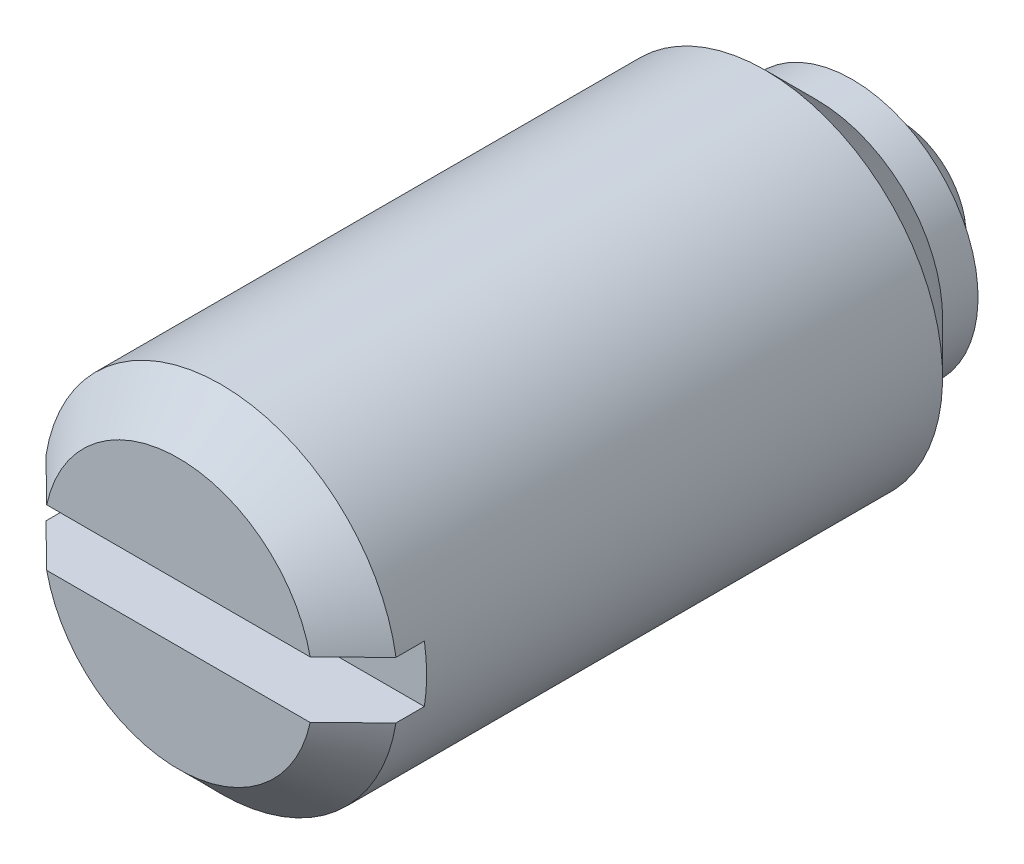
ISO-10303-21;
HEADER;
FILE_DESCRIPTION(('STEP AP214'),'2;1');
FILE_NAME('part.step','',(''),(''),'','','');
FILE_SCHEMA(('AUTOMOTIVE_DESIGN { 1 0 10303 214 1 1 1 1 }'));
ENDSEC;
DATA;
#1=APPLICATION_CONTEXT('core data for automotive mechanical design processes');
#2=APPLICATION_PROTOCOL_DEFINITION('international standard','automotive_design',2000,#1);
#3=PRODUCT_CONTEXT('',#1,'mechanical');
#4=PRODUCT('Part','Part','',(#3));
#5=PRODUCT_RELATED_PRODUCT_CATEGORY('part','',(#4));
#6=PRODUCT_DEFINITION_FORMATION('','',#4);
#7=PRODUCT_DEFINITION_CONTEXT('part definition',#1,'design');
#8=PRODUCT_DEFINITION('design','',#6,#7);
#9=PRODUCT_DEFINITION_SHAPE('','',#8);
#10=(LENGTH_UNIT() NAMED_UNIT(*) SI_UNIT(.MILLI.,.METRE.));
#11=(NAMED_UNIT(*) PLANE_ANGLE_UNIT() SI_UNIT($,.RADIAN.));
#12=(NAMED_UNIT(*) SI_UNIT($,.STERADIAN.) SOLID_ANGLE_UNIT());
#13=UNCERTAINTY_MEASURE_WITH_UNIT(LENGTH_MEASURE(1.E-05),#10,'distance_accuracy_value','');
#14=(GEOMETRIC_REPRESENTATION_CONTEXT(3) GLOBAL_UNCERTAINTY_ASSIGNED_CONTEXT((#13)) GLOBAL_UNIT_ASSIGNED_CONTEXT((#10,
#11,#12)) REPRESENTATION_CONTEXT('',''));
#15=CARTESIAN_POINT('',(0.,0.,0.));
#16=DIRECTION('',(0.,0.,1.));
#17=DIRECTION('',(1.,0.,0.));
#18=AXIS2_PLACEMENT_3D('',#15,#16,#17);
#19=CARTESIAN_POINT('',(0.,0.,1.));
#20=DIRECTION('',(0.,0.,-1.));
#21=DIRECTION('',(-1.,0.,0.));
#22=AXIS2_PLACEMENT_3D('',#19,#20,#21);
#23=CYLINDRICAL_SURFACE('',#22,5.);
#24=CARTESIAN_POINT('',(0.,0.,4.45));
#25=DIRECTION('',(0.,0.,-1.));
#26=DIRECTION('',(0.,1.,0.));
#27=AXIS2_PLACEMENT_3D('',#24,#25,#26);
#28=CIRCLE('',#27,5.);
#29=CARTESIAN_POINT('',(0.,5.,4.45));
#30=VERTEX_POINT('',#29);
#31=EDGE_CURVE('E93',#30,#30,#28,.T.);
#32=ORIENTED_EDGE('',*,*,#31,.F.);
#33=EDGE_LOOP('',(#32));
#34=FACE_BOUND('',#33,.T.);
#35=DIRECTION('',(0.,0.,1.));
#36=VECTOR('',#35,1.);
#37=CARTESIAN_POINT('',(4.93558507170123,-0.8,19.));
#38=LINE('',#37,#36);
#39=CARTESIAN_POINT('',(4.93558507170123,-0.8,19.));
#40=VERTEX_POINT('',#39);
#41=CARTESIAN_POINT('',(4.93558507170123,-0.8,19.8));
#42=VERTEX_POINT('',#41);
#43=EDGE_CURVE('E118',#40,#42,#38,.T.);
#44=ORIENTED_EDGE('',*,*,#43,.T.);
#45=CARTESIAN_POINT('',(0.,0.,19.8));
#46=DIRECTION('',(0.,0.,1.));
#47=DIRECTION('',(1.,0.,0.));
#48=AXIS2_PLACEMENT_3D('',#45,#46,#47);
#49=CIRCLE('',#48,5.);
#50=CARTESIAN_POINT('',(-4.93558507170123,-0.8,19.8));
#51=VERTEX_POINT('',#50);
#52=EDGE_CURVE('E94',#51,#42,#49,.T.);
#53=ORIENTED_EDGE('',*,*,#52,.F.);
#54=DIRECTION('',(0.,0.,1.));
#55=VECTOR('',#54,1.);
#56=CARTESIAN_POINT('',(-4.93558507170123,-0.8,19.));
#57=LINE('',#56,#55);
#58=CARTESIAN_POINT('',(-4.93558507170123,-0.8,19.));
#59=VERTEX_POINT('',#58);
#60=EDGE_CURVE('E34',#59,#51,#57,.T.);
#61=ORIENTED_EDGE('',*,*,#60,.F.);
#62=CARTESIAN_POINT('',(0.,0.,19.));
#63=DIRECTION('',(0.,0.,1.));
#64=DIRECTION('',(1.,0.,0.));
#65=AXIS2_PLACEMENT_3D('',#62,#63,#64);
#66=CIRCLE('',#65,5.);
#67=CARTESIAN_POINT('',(-4.93558507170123,0.8,19.));
#68=VERTEX_POINT('',#67);
#69=EDGE_CURVE('E80',#68,#59,#66,.T.);
#70=ORIENTED_EDGE('',*,*,#69,.F.);
#71=DIRECTION('',(0.,0.,1.));
#72=VECTOR('',#71,1.);
#73=CARTESIAN_POINT('',(-4.93558507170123,0.8,19.));
#74=LINE('',#73,#72);
#75=CARTESIAN_POINT('',(-4.93558507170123,0.8,19.8));
#76=VERTEX_POINT('',#75);
#77=EDGE_CURVE('E76',#68,#76,#74,.T.);
#78=ORIENTED_EDGE('',*,*,#77,.T.);
#79=CARTESIAN_POINT('',(4.93558507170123,0.8,19.8));
#80=VERTEX_POINT('',#79);
#81=EDGE_CURVE('E79',#80,#76,#49,.T.);
#82=ORIENTED_EDGE('',*,*,#81,.F.);
#83=DIRECTION('',(0.,0.,1.));
#84=VECTOR('',#83,1.);
#85=CARTESIAN_POINT('',(4.93558507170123,0.8,19.));
#86=LINE('',#85,#84);
#87=CARTESIAN_POINT('',(4.93558507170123,0.8,19.));
#88=VERTEX_POINT('',#87);
#89=EDGE_CURVE('E42',#88,#80,#86,.T.);
#90=ORIENTED_EDGE('',*,*,#89,.F.);
#91=EDGE_CURVE('E113',#40,#88,#66,.T.);
#92=ORIENTED_EDGE('',*,*,#91,.F.);
#93=EDGE_LOOP('',(#44,#53,#61,#70,#78,#82,#90,#92));
#94=FACE_BOUND('',#93,.T.);
#95=ADVANCED_FACE('F14',(#34,#94),#23,.T.);
#96=CARTESIAN_POINT('',(0.,5.,21.));
#97=DIRECTION('',(0.,0.,1.));
#98=DIRECTION('',(1.,0.,0.));
#99=AXIS2_PLACEMENT_3D('',#96,#97,#98);
#100=PLANE('',#99);
#101=CARTESIAN_POINT('',(0.,0.,21.));
#102=DIRECTION('',(0.,0.,1.));
#103=DIRECTION('',(1.,0.,0.));
#104=AXIS2_PLACEMENT_3D('',#101,#102,#103);
#105=CIRCLE('',#104,3.8);
#106=CARTESIAN_POINT('',(-3.71483512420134,-0.8,21.));
#107=VERTEX_POINT('',#106);
#108=CARTESIAN_POINT('',(3.71483512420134,-0.8,21.));
#109=VERTEX_POINT('',#108);
#110=EDGE_CURVE('E170',#107,#109,#105,.T.);
#111=ORIENTED_EDGE('',*,*,#110,.T.);
#112=DIRECTION('',(1.,0.,0.));
#113=VECTOR('',#112,1.);
#114=CARTESIAN_POINT('',(-4.93558507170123,-0.8,21.));
#115=LINE('',#114,#113);
#116=EDGE_CURVE('E108',#107,#109,#115,.T.);
#117=ORIENTED_EDGE('',*,*,#116,.F.);
#118=EDGE_LOOP('',(#111,#117));
#119=FACE_BOUND('',#118,.T.);
#120=ADVANCED_FACE('F158',(#119),#100,.T.);
#121=CARTESIAN_POINT('',(3.71483512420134,0.8,21.));
#122=VERTEX_POINT('',#121);
#123=CARTESIAN_POINT('',(-3.71483512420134,0.8,21.));
#124=VERTEX_POINT('',#123);
#125=EDGE_CURVE('E100',#122,#124,#105,.T.);
#126=ORIENTED_EDGE('',*,*,#125,.T.);
#127=DIRECTION('',(1.,0.,0.));
#128=VECTOR('',#127,1.);
#129=CARTESIAN_POINT('',(-4.93558507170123,0.8,21.));
#130=LINE('',#129,#128);
#131=EDGE_CURVE('E87',#124,#122,#130,.T.);
#132=ORIENTED_EDGE('',*,*,#131,.T.);
#133=EDGE_LOOP('',(#126,#132));
#134=FACE_BOUND('',#133,.T.);
#135=ADVANCED_FACE('F133',(#134),#100,.T.);
#136=CARTESIAN_POINT('',(0.,0.,19.8));
#137=DIRECTION('',(0.,0.,-1.));
#138=DIRECTION('',(-1.,0.,0.));
#139=AXIS2_PLACEMENT_3D('',#136,#137,#138);
#140=CONICAL_SURFACE('',#139,5.,0.785398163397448);
#141=CARTESIAN_POINT('',(-10.9020904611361,-0.8,13.8685967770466));
#142=CARTESIAN_POINT('',(-10.5220293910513,-0.8,14.2476303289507));
#143=CARTESIAN_POINT('',(-10.1419231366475,-0.8,14.6266186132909));
#144=CARTESIAN_POINT('',(-9.38154892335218,-0.8,15.3844569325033));
#145=CARTESIAN_POINT('',(-9.00128095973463,-0.8,15.7633069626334));
#146=CARTESIAN_POINT('',(-8.24025535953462,-0.8,16.5210765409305));
#147=CARTESIAN_POINT('',(-7.8594975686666,-0.8,16.8999959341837));
#148=CARTESIAN_POINT('',(-7.09767233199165,-0.8,17.6574999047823));
#149=CARTESIAN_POINT('',(-6.71660489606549,-0.8,18.0360844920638));
#150=CARTESIAN_POINT('',(-5.9587167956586,-0.8,18.7880092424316));
#151=CARTESIAN_POINT('',(-5.58190253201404,-0.8,19.1613558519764));
#152=CARTESIAN_POINT('',(-5.01598061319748,-0.8,19.720702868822));
#153=CARTESIAN_POINT('',(-4.82721428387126,-0.8,19.9070485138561));
#154=CARTESIAN_POINT('',(-4.44935817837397,-0.8,20.2794082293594));
#155=CARTESIAN_POINT('',(-4.26026840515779,-0.8,20.4654223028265));
#156=CARTESIAN_POINT('',(-3.88170325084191,-0.8,20.8368850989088));
#157=CARTESIAN_POINT('',(-3.69222808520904,-0.8,21.0223340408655));
#158=CARTESIAN_POINT('',(-3.31253993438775,-0.8,21.3924885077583));
#159=CARTESIAN_POINT('',(-3.12232692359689,-0.8,21.5771940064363));
#160=CARTESIAN_POINT('',(-2.74073953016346,-0.8,21.945343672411));
#161=CARTESIAN_POINT('',(-2.54936534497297,-0.8,22.1287880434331));
#162=CARTESIAN_POINT('',(-2.26063352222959,-0.8,22.402181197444));
#163=CARTESIAN_POINT('',(-2.16411387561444,-0.8,22.4930141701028));
#164=CARTESIAN_POINT('',(-1.97026206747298,-0.8,22.673808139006));
#165=CARTESIAN_POINT('',(-1.87292992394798,-0.8,22.7637691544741));
#166=CARTESIAN_POINT('',(-1.74816551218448,-0.8,22.8775109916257));
#167=CARTESIAN_POINT('',(-1.72129866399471,-0.8,22.9019121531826));
#168=CARTESIAN_POINT('',(-1.66745938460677,-0.8,22.9505978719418));
#169=CARTESIAN_POINT('',(-1.64048695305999,-0.8,22.9748824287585));
#170=CARTESIAN_POINT('',(-1.55938868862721,-0.8,23.047540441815));
#171=CARTESIAN_POINT('',(-1.50508472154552,-0.8,23.0957156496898));
#172=CARTESIAN_POINT('',(-1.39568905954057,-0.8,23.1915077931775));
#173=CARTESIAN_POINT('',(-1.34059545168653,-0.8,23.2391225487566));
#174=CARTESIAN_POINT('',(-1.22958246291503,-0.8,23.3333678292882));
#175=CARTESIAN_POINT('',(-1.17366319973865,-0.8,23.379998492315));
#176=CARTESIAN_POINT('',(-1.0656097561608,-0.8,23.4678504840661));
#177=CARTESIAN_POINT('',(-1.01357108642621,-0.8,23.509188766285));
#178=CARTESIAN_POINT('',(-0.908196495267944,-0.8,23.5901731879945));
#179=CARTESIAN_POINT('',(-0.854860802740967,-0.8,23.6298196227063));
#180=CARTESIAN_POINT('',(-0.746465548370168,-0.8,23.7065006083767));
#181=CARTESIAN_POINT('',(-0.691409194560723,-0.8,23.7435396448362));
#182=CARTESIAN_POINT('',(-0.578805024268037,-0.8,23.8135594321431));
#183=CARTESIAN_POINT('',(-0.521260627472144,-0.8,23.8465455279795));
#184=CARTESIAN_POINT('',(-0.411126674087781,-0.8,23.9016196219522));
#185=CARTESIAN_POINT('',(-0.358991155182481,-0.8,23.9245896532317));
#186=CARTESIAN_POINT('',(-0.251986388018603,-0.8,23.9627243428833));
#187=CARTESIAN_POINT('',(-0.197128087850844,-0.8,23.9779178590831));
#188=CARTESIAN_POINT('',(-0.0947531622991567,-0.8,23.9957042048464));
#189=CARTESIAN_POINT('',(-0.0475435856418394,-0.8,23.9999797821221));
#190=CARTESIAN_POINT('',(0.046845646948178,-0.8,24.000020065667));
#191=CARTESIAN_POINT('',(0.0940253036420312,-0.8,23.9957899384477));
#192=CARTESIAN_POINT('',(0.201408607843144,-0.8,23.9772270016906));
#193=CARTESIAN_POINT('',(0.261125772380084,-0.8,23.9601735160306));
#194=CARTESIAN_POINT('',(0.348198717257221,-0.800000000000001,23.9279331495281));
#195=CARTESIAN_POINT('',(0.376894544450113,-0.800000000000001,23.916026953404));
#196=CARTESIAN_POINT('',(0.433489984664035,-0.8,23.8904505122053));
#197=CARTESIAN_POINT('',(0.461389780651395,-0.8,23.8767806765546));
#198=CARTESIAN_POINT('',(0.536913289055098,-0.8,23.837404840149));
#199=CARTESIAN_POINT('',(0.583799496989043,-0.8,23.8102987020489));
#200=CARTESIAN_POINT('',(0.675882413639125,-0.800000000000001,23.7533323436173));
#201=CARTESIAN_POINT('',(0.721077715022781,-0.8,23.7234698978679));
#202=CARTESIAN_POINT('',(0.810273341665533,-0.8,23.6617985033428));
#203=CARTESIAN_POINT('',(0.854270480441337,-0.8,23.6299849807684));
#204=CARTESIAN_POINT('',(0.941273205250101,-0.8,23.5650249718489));
#205=CARTESIAN_POINT('',(0.98427862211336,-0.8,23.531878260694));
#206=CARTESIAN_POINT('',(1.11263812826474,-0.8,23.4306366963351));
#207=CARTESIAN_POINT('',(1.19684597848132,-0.8,23.3610921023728));
#208=CARTESIAN_POINT('',(1.3216828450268,-0.8,23.2552087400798));
#209=CARTESIAN_POINT('',(1.36301551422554,-0.800000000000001,23.2196834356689));
#210=CARTESIAN_POINT('',(1.44529784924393,-0.8,23.1481928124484));
#211=CARTESIAN_POINT('',(1.48624752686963,-0.8,23.1122275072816));
#212=CARTESIAN_POINT('',(1.60742153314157,-0.8,23.0048935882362));
#213=CARTESIAN_POINT('',(1.68720596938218,-0.8,22.9330292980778));
#214=CARTESIAN_POINT('',(1.84596084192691,-0.800000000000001,22.7884055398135));
#215=CARTESIAN_POINT('',(1.92493125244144,-0.800000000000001,22.7156460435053));
#216=CARTESIAN_POINT('',(2.1609957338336,-0.8,22.496427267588));
#217=CARTESIAN_POINT('',(2.31722802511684,-0.8,22.349041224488));
#218=CARTESIAN_POINT('',(2.6285549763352,-0.800000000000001,22.0528081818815));
#219=CARTESIAN_POINT('',(2.78364852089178,-0.800000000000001,21.9039600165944));
#220=CARTESIAN_POINT('',(3.09302913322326,-0.800000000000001,21.6054455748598));
#221=CARTESIAN_POINT('',(3.24731624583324,-0.800000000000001,21.4557793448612));
#222=CARTESIAN_POINT('',(3.55440275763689,-0.800000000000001,21.1568476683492));
#223=CARTESIAN_POINT('',(3.70720542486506,-0.800000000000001,21.0075855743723));
#224=CARTESIAN_POINT('',(4.01245165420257,-0.800000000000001,20.7086903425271));
#225=CARTESIAN_POINT('',(4.16489521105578,-0.800000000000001,20.5590571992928));
#226=CARTESIAN_POINT('',(4.62173704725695,-0.800000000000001,20.1098673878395));
#227=CARTESIAN_POINT('',(4.925750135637,-0.8,19.8099191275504));
#228=CARTESIAN_POINT('',(5.70175323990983,-0.8,19.0428404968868));
#229=CARTESIAN_POINT('',(6.1733400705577,-0.800000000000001,18.5753026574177));
#230=CARTESIAN_POINT('',(7.11589856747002,-0.800000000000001,17.6394867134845));
#231=CARTESIAN_POINT('',(7.58687014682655,-0.800000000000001,17.1712085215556));
#232=CARTESIAN_POINT('',(8.53205500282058,-0.800000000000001,16.2306512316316));
#233=CARTESIAN_POINT('',(9.00626528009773,-0.800000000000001,15.7583691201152));
#234=CARTESIAN_POINT('',(9.95436699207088,-0.800000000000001,14.8136100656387));
#235=CARTESIAN_POINT('',(10.4282584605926,-0.800000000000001,14.3411331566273));
#236=CARTESIAN_POINT('',(10.9020904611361,-0.8,13.8685967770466));
#237=B_SPLINE_CURVE_WITH_KNOTS('',3,(#141,#142,#143,#144,#145,#146,#147,#148,#149,#150,#151,
#152,#153,#154,#155,#156,#157,#158,#159,#160,#161,#162,#163,#164,#165,#166,#167,#168,#169,#170,
#171,#172,#173,#174,#175,#176,#177,#178,#179,#180,#181,#182,#183,#184,#185,#186,#187,#188,#189,
#190,#191,#192,#193,#194,#195,#196,#197,#198,#199,#200,#201,#202,#203,#204,#205,#206,#207,#208,
#209,#210,#211,#212,#213,#214,#215,#216,#217,#218,#219,#220,#221,#222,#223,#224,#225,#226,#227,
#228,#229,#230,#231,#232,#233,#234,#235,#236),.UNSPECIFIED.,.F.,.F.,(4,2,2,2,2,2,2,2,2,2,2,2,2,
2,2,2,2,2,2,2,2,2,2,2,2,2,2,2,2,2,2,2,2,2,2,2,2,2,2,2,2,2,2,2,2,2,2,4),(0.,1.61028437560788,
3.22061958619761,4.83214282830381,6.44361652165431,8.03496399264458,8.83071293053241,
9.62645463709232,10.4218330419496,11.2172392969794,12.0125138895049,12.4101289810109,
12.8077352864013,12.9166165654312,13.0254982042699,13.2432730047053,13.4617194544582,
13.6801350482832,13.8794913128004,14.0788126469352,14.2777822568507,14.4764865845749,
14.6470220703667,14.8169200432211,14.9583961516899,15.0997863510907,15.2849198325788,
15.3780907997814,15.4712401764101,15.63355803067,15.7960081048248,15.9588547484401,
16.1217289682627,16.449283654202,16.6127889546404,16.7762891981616,17.0984121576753,
17.4205452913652,18.0648722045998,18.7097630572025,19.3546176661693,19.9954370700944,
20.6362657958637,21.9174886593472,23.9096900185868,25.9021475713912,27.9099651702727,
29.917517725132),.UNSPECIFIED.);
#238=EDGE_CURVE('E9',#51,#107,#237,.T.);
#239=ORIENTED_EDGE('',*,*,#238,.F.);
#240=ORIENTED_EDGE('',*,*,#52,.T.);
#241=EDGE_CURVE('E18',#109,#42,#237,.T.);
#242=ORIENTED_EDGE('',*,*,#241,.F.);
#243=ORIENTED_EDGE('',*,*,#110,.F.);
#244=EDGE_LOOP('',(#239,#240,#242,#243));
#245=FACE_BOUND('',#244,.T.);
#246=ADVANCED_FACE('F127',(#245),#140,.T.);
#247=CARTESIAN_POINT('',(10.9020904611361,0.8,13.8685967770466));
#248=CARTESIAN_POINT('',(10.5220293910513,0.799999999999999,14.2476303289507));
#249=CARTESIAN_POINT('',(10.1419231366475,0.799999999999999,14.6266186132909));
#250=CARTESIAN_POINT('',(9.38154892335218,0.799999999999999,15.3844569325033));
#251=CARTESIAN_POINT('',(9.00128095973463,0.799999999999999,15.7633069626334));
#252=CARTESIAN_POINT('',(8.24025535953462,0.799999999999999,16.5210765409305));
#253=CARTESIAN_POINT('',(7.8594975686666,0.799999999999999,16.8999959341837));
#254=CARTESIAN_POINT('',(7.09767233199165,0.8,17.6574999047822));
#255=CARTESIAN_POINT('',(6.71660489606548,0.8,18.0360844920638));
#256=CARTESIAN_POINT('',(5.9587167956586,0.8,18.7880092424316));
#257=CARTESIAN_POINT('',(5.58190253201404,0.8,19.1613558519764));
#258=CARTESIAN_POINT('',(5.01598061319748,0.8,19.720702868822));
#259=CARTESIAN_POINT('',(4.82721428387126,0.8,19.9070485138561));
#260=CARTESIAN_POINT('',(4.44935817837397,0.8,20.2794082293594));
#261=CARTESIAN_POINT('',(4.26026840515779,0.8,20.4654223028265));
#262=CARTESIAN_POINT('',(3.88170325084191,0.8,20.8368850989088));
#263=CARTESIAN_POINT('',(3.69222808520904,0.8,21.0223340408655));
#264=CARTESIAN_POINT('',(3.31253993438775,0.8,21.3924885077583));
#265=CARTESIAN_POINT('',(3.12232692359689,0.8,21.5771940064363));
#266=CARTESIAN_POINT('',(2.74073953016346,0.8,21.945343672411));
#267=CARTESIAN_POINT('',(2.54936534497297,0.8,22.1287880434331));
#268=CARTESIAN_POINT('',(2.26063352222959,0.800000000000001,22.402181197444));
#269=CARTESIAN_POINT('',(2.16411387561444,0.800000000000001,22.4930141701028));
#270=CARTESIAN_POINT('',(1.97026206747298,0.8,22.673808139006));
#271=CARTESIAN_POINT('',(1.87292992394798,0.799999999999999,22.7637691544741));
#272=CARTESIAN_POINT('',(1.74816551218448,0.8,22.8775109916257));
#273=CARTESIAN_POINT('',(1.72129866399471,0.800000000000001,22.9019121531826));
#274=CARTESIAN_POINT('',(1.66745938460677,0.800000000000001,22.9505978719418));
#275=CARTESIAN_POINT('',(1.64048695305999,0.800000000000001,22.9748824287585));
#276=CARTESIAN_POINT('',(1.55938868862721,0.800000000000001,23.047540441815));
#277=CARTESIAN_POINT('',(1.50508472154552,0.800000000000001,23.0957156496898));
#278=CARTESIAN_POINT('',(1.39568905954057,0.800000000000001,23.1915077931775));
#279=CARTESIAN_POINT('',(1.34059545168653,0.800000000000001,23.2391225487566));
#280=CARTESIAN_POINT('',(1.22958246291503,0.800000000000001,23.3333678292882));
#281=CARTESIAN_POINT('',(1.17366319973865,0.8,23.379998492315));
#282=CARTESIAN_POINT('',(1.0656097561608,0.8,23.4678504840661));
#283=CARTESIAN_POINT('',(1.01357108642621,0.800000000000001,23.509188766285));
#284=CARTESIAN_POINT('',(0.908196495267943,0.800000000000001,23.5901731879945));
#285=CARTESIAN_POINT('',(0.854860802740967,0.800000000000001,23.6298196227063));
#286=CARTESIAN_POINT('',(0.746465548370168,0.800000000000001,23.7065006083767));
#287=CARTESIAN_POINT('',(0.691409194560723,0.800000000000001,23.7435396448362));
#288=CARTESIAN_POINT('',(0.578805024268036,0.800000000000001,23.8135594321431));
#289=CARTESIAN_POINT('',(0.521260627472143,0.8,23.8465455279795));
#290=CARTESIAN_POINT('',(0.411126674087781,0.8,23.9016196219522));
#291=CARTESIAN_POINT('',(0.358991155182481,0.800000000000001,23.9245896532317));
#292=CARTESIAN_POINT('',(0.251986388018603,0.800000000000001,23.9627243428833));
#293=CARTESIAN_POINT('',(0.197128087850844,0.8,23.9779178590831));
#294=CARTESIAN_POINT('',(0.0947531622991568,0.8,23.9957042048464));
#295=CARTESIAN_POINT('',(0.0475435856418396,0.800000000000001,23.9999797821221));
#296=CARTESIAN_POINT('',(-0.0468456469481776,0.800000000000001,24.000020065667));
#297=CARTESIAN_POINT('',(-0.0940253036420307,0.8,23.9957899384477));
#298=CARTESIAN_POINT('',(-0.201408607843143,0.8,23.9772270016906));
#299=CARTESIAN_POINT('',(-0.261125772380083,0.800000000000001,23.9601735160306));
#300=CARTESIAN_POINT('',(-0.34819871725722,0.800000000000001,23.9279331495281));
#301=CARTESIAN_POINT('',(-0.376894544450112,0.800000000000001,23.916026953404));
#302=CARTESIAN_POINT('',(-0.433489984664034,0.800000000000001,23.8904505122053));
#303=CARTESIAN_POINT('',(-0.461389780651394,0.8,23.8767806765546));
#304=CARTESIAN_POINT('',(-0.536913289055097,0.8,23.837404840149));
#305=CARTESIAN_POINT('',(-0.583799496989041,0.800000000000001,23.8102987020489));
#306=CARTESIAN_POINT('',(-0.675882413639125,0.800000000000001,23.7533323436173));
#307=CARTESIAN_POINT('',(-0.721077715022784,0.800000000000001,23.7234698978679));
#308=CARTESIAN_POINT('',(-0.810273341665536,0.800000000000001,23.6617985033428));
#309=CARTESIAN_POINT('',(-0.854270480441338,0.800000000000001,23.6299849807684));
#310=CARTESIAN_POINT('',(-0.941273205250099,0.800000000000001,23.5650249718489));
#311=CARTESIAN_POINT('',(-0.984278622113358,0.800000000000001,23.531878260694));
#312=CARTESIAN_POINT('',(-1.11263812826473,0.800000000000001,23.4306366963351));
#313=CARTESIAN_POINT('',(-1.19684597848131,0.800000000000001,23.3610921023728));
#314=CARTESIAN_POINT('',(-1.3216828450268,0.800000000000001,23.2552087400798));
#315=CARTESIAN_POINT('',(-1.36301551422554,0.800000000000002,23.2196834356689));
#316=CARTESIAN_POINT('',(-1.44529784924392,0.800000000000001,23.1481928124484));
#317=CARTESIAN_POINT('',(-1.48624752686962,0.8,23.1122275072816));
#318=CARTESIAN_POINT('',(-1.60742153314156,0.799999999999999,23.0048935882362));
#319=CARTESIAN_POINT('',(-1.68720596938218,0.800000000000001,22.9330292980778));
#320=CARTESIAN_POINT('',(-1.84596084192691,0.800000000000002,22.7884055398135));
#321=CARTESIAN_POINT('',(-1.92493125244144,0.800000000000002,22.7156460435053));
#322=CARTESIAN_POINT('',(-2.1609957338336,0.800000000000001,22.496427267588));
#323=CARTESIAN_POINT('',(-2.31722802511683,0.800000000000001,22.349041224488));
#324=CARTESIAN_POINT('',(-2.6285549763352,0.800000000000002,22.0528081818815));
#325=CARTESIAN_POINT('',(-2.78364852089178,0.800000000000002,21.9039600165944));
#326=CARTESIAN_POINT('',(-3.09302913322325,0.800000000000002,21.6054455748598));
#327=CARTESIAN_POINT('',(-3.24731624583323,0.800000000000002,21.4557793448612));
#328=CARTESIAN_POINT('',(-3.55440275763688,0.800000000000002,21.1568476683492));
#329=CARTESIAN_POINT('',(-3.70720542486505,0.800000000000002,21.0075855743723));
#330=CARTESIAN_POINT('',(-4.01245165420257,0.800000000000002,20.7086903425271));
#331=CARTESIAN_POINT('',(-4.16489521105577,0.800000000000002,20.5590571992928));
#332=CARTESIAN_POINT('',(-4.62173704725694,0.800000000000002,20.1098673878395));
#333=CARTESIAN_POINT('',(-4.92575013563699,0.8,19.8099191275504));
#334=CARTESIAN_POINT('',(-5.70175323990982,0.8,19.0428404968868));
#335=CARTESIAN_POINT('',(-6.17334007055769,0.800000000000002,18.5753026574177));
#336=CARTESIAN_POINT('',(-7.11589856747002,0.800000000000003,17.6394867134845));
#337=CARTESIAN_POINT('',(-7.58687014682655,0.800000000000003,17.1712085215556));
#338=CARTESIAN_POINT('',(-8.53205500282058,0.800000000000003,16.2306512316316));
#339=CARTESIAN_POINT('',(-9.00626528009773,0.800000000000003,15.7583691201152));
#340=CARTESIAN_POINT('',(-9.95436699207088,0.800000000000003,14.8136100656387));
#341=CARTESIAN_POINT('',(-10.4282584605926,0.800000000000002,14.3411331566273));
#342=CARTESIAN_POINT('',(-10.9020904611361,0.8,13.8685967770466));
#343=B_SPLINE_CURVE_WITH_KNOTS('',3,(#247,#248,#249,#250,#251,#252,#253,#254,#255,#256,#257,
#258,#259,#260,#261,#262,#263,#264,#265,#266,#267,#268,#269,#270,#271,#272,#273,#274,#275,#276,
#277,#278,#279,#280,#281,#282,#283,#284,#285,#286,#287,#288,#289,#290,#291,#292,#293,#294,#295,
#296,#297,#298,#299,#300,#301,#302,#303,#304,#305,#306,#307,#308,#309,#310,#311,#312,#313,#314,
#315,#316,#317,#318,#319,#320,#321,#322,#323,#324,#325,#326,#327,#328,#329,#330,#331,#332,#333,
#334,#335,#336,#337,#338,#339,#340,#341,#342),.UNSPECIFIED.,.F.,.F.,(4,2,2,2,2,2,2,2,2,2,2,2,2,
2,2,2,2,2,2,2,2,2,2,2,2,2,2,2,2,2,2,2,2,2,2,2,2,2,2,2,2,2,2,2,2,2,2,4),(0.,1.61028437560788,
3.22061958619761,4.83214282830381,6.44361652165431,8.03496399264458,8.83071293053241,
9.62645463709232,10.4218330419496,11.2172392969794,12.0125138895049,12.4101289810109,
12.8077352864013,12.9166165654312,13.0254982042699,13.2432730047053,13.4617194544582,
13.6801350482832,13.8794913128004,14.0788126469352,14.2777822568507,14.4764865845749,
14.6470220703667,14.8169200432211,14.9583961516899,15.0997863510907,15.2849198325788,
15.3780907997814,15.4712401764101,15.63355803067,15.7960081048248,15.9588547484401,
16.1217289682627,16.449283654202,16.6127889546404,16.7762891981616,17.0984121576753,
17.4205452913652,18.0648722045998,18.7097630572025,19.3546176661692,19.9954370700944,
20.6362657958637,21.9174886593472,23.9096900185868,25.9021475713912,27.9099651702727,
29.917517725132),.UNSPECIFIED.);
#344=EDGE_CURVE('E91',#80,#122,#343,.T.);
#345=ORIENTED_EDGE('',*,*,#344,.F.);
#346=ORIENTED_EDGE('',*,*,#81,.T.);
#347=EDGE_CURVE('E85',#124,#76,#343,.T.);
#348=ORIENTED_EDGE('',*,*,#347,.F.);
#349=ORIENTED_EDGE('',*,*,#125,.F.);
#350=EDGE_LOOP('',(#345,#346,#348,#349));
#351=FACE_BOUND('',#350,.T.);
#352=ADVANCED_FACE('F92',(#351),#140,.T.);
#353=CARTESIAN_POINT('',(-4.93558507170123,0.8,19.));
#354=DIRECTION('',(0.,-1.,0.));
#355=DIRECTION('',(1.,0.,0.));
#356=AXIS2_PLACEMENT_3D('',#353,#354,#355);
#357=PLANE('',#356);
#358=ORIENTED_EDGE('',*,*,#131,.F.);
#359=ORIENTED_EDGE('',*,*,#347,.T.);
#360=ORIENTED_EDGE('',*,*,#77,.F.);
#361=DIRECTION('',(1.,0.,0.));
#362=VECTOR('',#361,1.);
#363=CARTESIAN_POINT('',(-4.93558507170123,0.8,19.));
#364=LINE('',#363,#362);
#365=EDGE_CURVE('E115',#68,#88,#364,.T.);
#366=ORIENTED_EDGE('',*,*,#365,.T.);
#367=ORIENTED_EDGE('',*,*,#89,.T.);
#368=ORIENTED_EDGE('',*,*,#344,.T.);
#369=EDGE_LOOP('',(#358,#359,#360,#366,#367,#368));
#370=FACE_BOUND('',#369,.T.);
#371=ADVANCED_FACE('F86',(#370),#357,.T.);
#372=CARTESIAN_POINT('',(-4.93558507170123,-0.8,19.));
#373=DIRECTION('',(0.,-1.,0.));
#374=DIRECTION('',(1.,0.,0.));
#375=AXIS2_PLACEMENT_3D('',#372,#373,#374);
#376=PLANE('',#375);
#377=ORIENTED_EDGE('',*,*,#60,.T.);
#378=ORIENTED_EDGE('',*,*,#238,.T.);
#379=ORIENTED_EDGE('',*,*,#116,.T.);
#380=ORIENTED_EDGE('',*,*,#241,.T.);
#381=ORIENTED_EDGE('',*,*,#43,.F.);
#382=DIRECTION('',(1.,0.,0.));
#383=VECTOR('',#382,1.);
#384=CARTESIAN_POINT('',(-4.93558507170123,-0.8,19.));
#385=LINE('',#384,#383);
#386=EDGE_CURVE('E111',#59,#40,#385,.T.);
#387=ORIENTED_EDGE('',*,*,#386,.F.);
#388=EDGE_LOOP('',(#377,#378,#379,#380,#381,#387));
#389=FACE_BOUND('',#388,.T.);
#390=ADVANCED_FACE('F145',(#389),#376,.F.);
#391=CARTESIAN_POINT('',(0.,0.,19.));
#392=DIRECTION('',(0.,0.,1.));
#393=DIRECTION('',(1.,0.,0.));
#394=AXIS2_PLACEMENT_3D('',#391,#392,#393);
#395=PLANE('',#394);
#396=ORIENTED_EDGE('',*,*,#69,.T.);
#397=ORIENTED_EDGE('',*,*,#386,.T.);
#398=ORIENTED_EDGE('',*,*,#91,.T.);
#399=ORIENTED_EDGE('',*,*,#365,.F.);
#400=EDGE_LOOP('',(#396,#397,#398,#399));
#401=FACE_BOUND('',#400,.T.);
#402=ADVANCED_FACE('F143',(#401),#395,.T.);
#403=CARTESIAN_POINT('',(0.,0.,-0.90496356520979));
#404=DIRECTION('',(0.,0.,-1.));
#405=DIRECTION('',(0.,1.,0.));
#406=AXIS2_PLACEMENT_3D('',#403,#404,#405);
#407=CYLINDRICAL_SURFACE('',#406,3.55);
#408=CARTESIAN_POINT('',(0.,0.,2.));
#409=DIRECTION('',(0.,0.,-1.));
#410=DIRECTION('',(0.,1.,0.));
#411=AXIS2_PLACEMENT_3D('',#408,#409,#410);
#412=CIRCLE('',#411,3.55);
#413=CARTESIAN_POINT('',(0.,3.55,2.));
#414=VERTEX_POINT('',#413);
#415=EDGE_CURVE('E105',#414,#414,#412,.T.);
#416=ORIENTED_EDGE('',*,*,#415,.F.);
#417=EDGE_LOOP('',(#416));
#418=FACE_BOUND('',#417,.T.);
#419=CARTESIAN_POINT('',(0.,0.,3.));
#420=DIRECTION('',(0.,0.,-1.));
#421=DIRECTION('',(0.,1.,0.));
#422=AXIS2_PLACEMENT_3D('',#419,#420,#421);
#423=CIRCLE('',#422,3.55);
#424=CARTESIAN_POINT('',(0.,3.55,3.));
#425=VERTEX_POINT('',#424);
#426=EDGE_CURVE('E97',#425,#425,#423,.T.);
#427=ORIENTED_EDGE('',*,*,#426,.T.);
#428=EDGE_LOOP('',(#427));
#429=FACE_BOUND('',#428,.T.);
#430=ADVANCED_FACE('F139',(#418,#429),#407,.T.);
#431=CARTESIAN_POINT('',(0.,0.,4.45));
#432=DIRECTION('',(0.,0.,1.));
#433=DIRECTION('',(0.,-1.,0.));
#434=AXIS2_PLACEMENT_3D('',#431,#432,#433);
#435=CONICAL_SURFACE('',#434,5.,0.785398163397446);
#436=ORIENTED_EDGE('',*,*,#426,.F.);
#437=EDGE_LOOP('',(#436));
#438=FACE_BOUND('',#437,.T.);
#439=ORIENTED_EDGE('',*,*,#31,.T.);
#440=EDGE_LOOP('',(#439));
#441=FACE_BOUND('',#440,.T.);
#442=ADVANCED_FACE('F135',(#438,#441),#435,.T.);
#443=CARTESIAN_POINT('',(0.,0.,3.));
#444=DIRECTION('',(-1.,0.,0.));
#445=DIRECTION('',(0.,0.,1.));
#446=AXIS2_PLACEMENT_3D('',#443,#444,#445);
#447=SPHERICAL_SURFACE('',#446,3.);
#448=CARTESIAN_POINT('',(0.,0.,3.));
#449=DIRECTION('',(0.,0.,-1.));
#450=DIRECTION('',(-1.,0.,0.));
#451=AXIS2_PLACEMENT_3D('',#448,#449,#450);
#452=SPHERICAL_SURFACE('',#451,3.);
#453=CARTESIAN_POINT('',(0.,0.,2.));
#454=DIRECTION('',(0.,0.,-1.));
#455=DIRECTION('',(-1.,0.,0.));
#456=AXIS2_PLACEMENT_3D('',#453,#454,#455);
#457=CIRCLE('',#456,2.82842712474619);
#458=CARTESIAN_POINT('',(-2.82842712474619,0.,2.));
#459=VERTEX_POINT('',#458);
#460=EDGE_CURVE('E82',#459,#459,#457,.T.);
#461=ORIENTED_EDGE('',*,*,#460,.T.);
#462=EDGE_LOOP('',(#461));
#463=FACE_BOUND('',#462,.T.);
#464=ADVANCED_FACE('F16',(#463),#452,.T.);
#465=CARTESIAN_POINT('',(0.,2.82842712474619,2.));
#466=DIRECTION('',(0.,0.,-1.));
#467=DIRECTION('',(-1.,0.,0.));
#468=AXIS2_PLACEMENT_3D('',#465,#466,#467);
#469=PLANE('',#468);
#470=ORIENTED_EDGE('',*,*,#415,.T.);
#471=EDGE_LOOP('',(#470));
#472=FACE_BOUND('',#471,.T.);
#473=ORIENTED_EDGE('',*,*,#460,.F.);
#474=EDGE_LOOP('',(#473));
#475=FACE_BOUND('',#474,.T.);
#476=ADVANCED_FACE('F153',(#472,#475),#469,.T.);
#477=CLOSED_SHELL('',(#95,#120,#135,#246,#352,#371,#390,#402,#430,#442,#464,#476));
#478=MANIFOLD_SOLID_BREP('B1',#477);
#479=ADVANCED_BREP_SHAPE_REPRESENTATION('',(#18,#478),#14);
#480=SHAPE_DEFINITION_REPRESENTATION(#9,#479);
ENDSEC;
END-ISO-10303-21;
